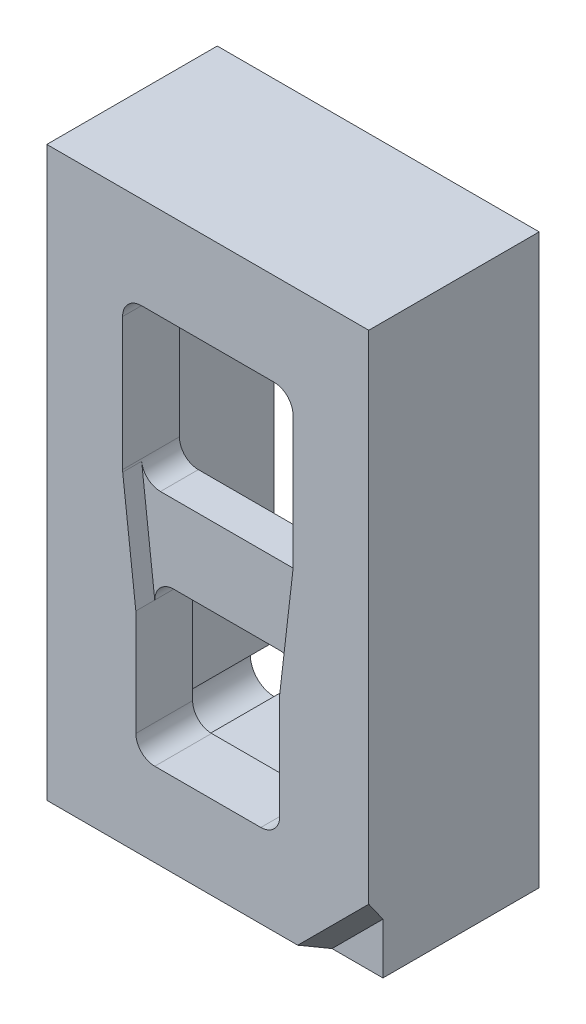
from build123d import *

# Parameters (mm, degrees)
SKETCH1_W           = 2.2
SKETCH1_H           = 4.8
SKETCH1_W_2         = 1.8
SKETCH1_H_2         = 1.8
SKETCH1_W_3         = 1.52
SKETCH1_H_3         = 1.52
BOSS_EXTRUDE1_DEPTH = 0.6
SKETCH2_W           = 3.4
SKETCH2_H           = 6
SKETCH2_W_2         = 2.2
SKETCH2_H_2         = 4.8
BOSS_EXTRUDE2_DEPTH = 1.2
SKETCH3_W           = 3.4
SKETCH3_H           = 6
SKETCH3_W_2         = 2.2
SKETCH3_H_2         = 4.8
BOSS_EXTRUDE3_DEPTH = 0.6
CUT_EXTRUDE1_DEPTH  = 0.15
FILLET1_R           = 0.2
DRAFT1_ANGLE        = 45
CUT_EXTRUDE2_DEPTH  = 0.2
SKETCH9_R           = 0.25
CUT_EXTRUDE4_DEPTH  = 1.2


with BuildPart() as part:
    # Sketch1 → Boss-Extrude1 (new body)
    with BuildSketch(Plane.XY):
        Rectangle(SKETCH1_W, SKETCH1_H)
        with Locations((0, 1.125)):
            Rectangle(SKETCH1_W_2, SKETCH1_H_2, mode=Mode.SUBTRACT)
        with Locations((0, -1.358)):
            Rectangle(SKETCH1_W_3, SKETCH1_H_3, mode=Mode.SUBTRACT)
    extrude(amount=BOSS_EXTRUDE1_DEPTH)



with BuildPart() as body_2:
    # Sketch2 → Boss-Extrude2 (new body)
    with BuildSketch(Plane.XY):
        Rectangle(SKETCH2_W, SKETCH2_H)
        Rectangle(SKETCH2_W_2, SKETCH2_H_2, mode=Mode.SUBTRACT)
    extrude(amount=-BOSS_EXTRUDE2_DEPTH)


with BuildPart() as part_1:
    add(part.part)

    add(body_2.part)  # Boss-Extrude3 merges body 2
    # Sketch3 → Boss-Extrude3 (add)
    with BuildSketch(Plane.XY):
        Rectangle(SKETCH3_W, SKETCH3_H)
        Rectangle(SKETCH3_W_2, SKETCH3_H_2, mode=Mode.SUBTRACT)
    extrude(amount=BOSS_EXTRUDE3_DEPTH)

    # Sketch4 → Cut-Extrude1 (cut)
    with BuildSketch(Plane.XY.offset(0.6)):
        Polygon((1.7, -3), (0.95, -3), (1.7, -2.25), align=None)
    extrude(amount=-CUT_EXTRUDE1_DEPTH, mode=Mode.SUBTRACT)

    # Fillet1
    fillet1_edges = [part_1.edges().sort_by_distance(p)[0] for p in [
        (0.9, 0.225, 0.3),
        (0.9, 2.025, 0.3),
        (-0.9, 2.025, 0.3),
        (-0.9, 0.225, 0.3),
        (0.76, -2.118, 0.3),
        (0.76, -0.598, 0.3),
        (-0.76, -0.598, 0.3),
        (-0.76, -2.118, 0.3),
    ]]
    fillet(fillet1_edges, radius=FILLET1_R)

    # Draft1
    draft1_faces = [part_1.faces().sort_by_distance(p)[0] for p in [
        (1.325, -2.625, 0.525),
    ]]
    draft(draft1_faces, Plane.XY.offset(0.6), DRAFT1_ANGLE)

    # Sketch5 → Cut-Extrude2 (cut)
    with BuildSketch(Plane.XY.offset(0.6)):
        Polygon((-0.898677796, 0.402040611), (-0.76, -0.798), (0.76, -0.798), (0.898677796, 0.402040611), align=None)
    extrude(amount=-CUT_EXTRUDE2_DEPTH, mode=Mode.SUBTRACT)

    # Sketch9 → Cut-Extrude4 (cut)
    with BuildSketch(Plane(origin=(0, 0, -1.2), x_dir=(-1, 0, 0), z_dir=(0, 0, -1))):
        with Locations((1.1, 2.4)):
            Circle(SKETCH9_R)
        with Locations((-1.1, 2.4)):
            Circle(SKETCH9_R)
        with Locations((1.1, -2.4)):
            Circle(SKETCH9_R)
        with Locations((-1.1, -2.4)):
            Circle(SKETCH9_R)
    extrude(amount=-CUT_EXTRUDE4_DEPTH, mode=Mode.SUBTRACT)


solid = part_1.part
